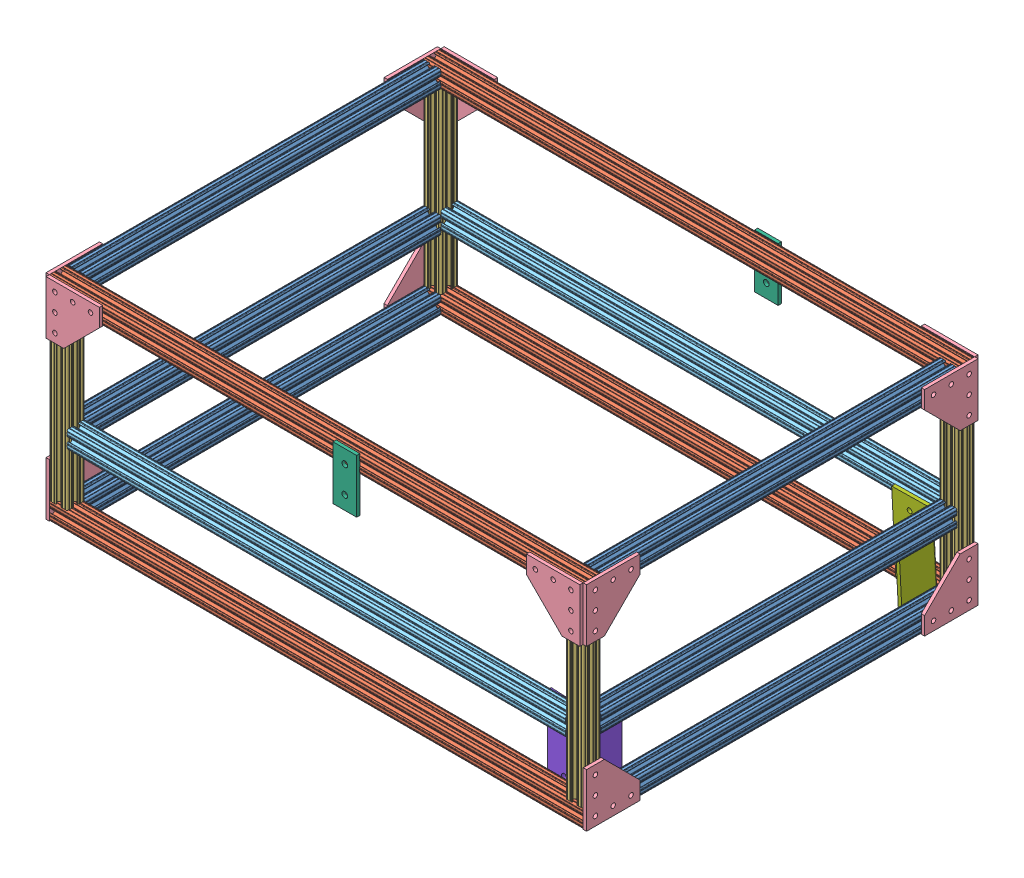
SolidWorks assembly Base Without Wheels+Plate+Angle iron.SLDASM, configuration Default (file format 10000). Lengths in mm.
Overall size (771.55 304.86 568.83).
32 component instances, 8 part files, 77 mates.
Components (placement in the parent):
- 1010 20in-2: 1010 20in.SLDPRT [Default] at (231.3281 508 268.5426) size (25.4 25.4 508)
- 1010 30in-1: 1010 30in.SLDPRT [Default] at (-517.9719 508 281.2426) x (0 0 1) z (-1 0 0) size (25.4 25.4 762)
- 1010 30in-2: 1010 30in.SLDPRT [Default] at (-517.9719 508 -252.1574) x (0 0 1) z (-1 0 0) size (25.4 25.4 762)
- 1010 20in-3: 1010 20in.SLDPRT [Default] at (-505.2719 508 268.5426) size (25.4 25.4 508)
- 1010 10in-1: 1010 10in.SLDPRT [Default] at (231.3281 520.7 281.2426) x (1 0 0) z (0 -1 0) size (25.4 25.4 254)
- 1010 10in-2: 1010 10in.SLDPRT [Default] at (231.3281 520.7 -252.1574) x (1 0 0) z (0 -1 0) size (25.4 25.4 254)
- 1010 10in-3: 1010 10in.SLDPRT [Default] at (-505.2719 520.7 -252.1574) x (1 0 0) z (0 -1 0) size (25.4 25.4 254)
- 1010 10in-4: 1010 10in.SLDPRT [Default] at (-505.2719 520.7 281.2426) x (1 0 0) z (0 -1 0) size (25.4 25.4 254)
- 1010 30in-3: 1010 30in.SLDPRT [Default] at (244.0281 787.4 -252.1574) x (0 0 -1) z (1 0 0) size (25.4 25.4 762)
- 1010 20in-4: 1010 20in.SLDPRT [Default] at (231.3281 787.4 268.5426) size (25.4 25.4 508)
- 1010 30in-4: 1010 30in.SLDPRT [Default] at (-517.9719 787.4 281.2426) x (0 -1 0) z (-1 0 0) size (25.4 25.4 762)
- 1010 20in-5: 1010 20in.SLDPRT [Default] at (-505.2719 787.4 268.5426) size (25.4 25.4 508)
- 4151-1: 4151.sldprt [Default] at (248.8033 495.3 255.8426) x (0 0 1) z (-1 0 0) size (76.2 76.2 4.78)
- 4151-2: 4151.sldprt [Default] at (244.0281 495.3 -226.7574) x (0 0 -1) z (1 0 0) size (76.2 76.2 4.78)
- 4151-3: 4151.sldprt [Default] at (-522.7471 533.4 293.9426) x (0 -1 0) z (1 0 0) size (76.2 76.2 4.78)
- 4151-4: 4151.sldprt [Default] at (-522.7471 495.3 -226.7574) x (0 0 -1) z (1 0 0) size (76.2 76.2 4.78)
- 4151-5: 4151.sldprt [Default] at (248.8033 800.1 -226.7574) x (0 0 -1) z (-1 0 0) size (76.2 76.2 4.78)
- 4151-6: 4151.sldprt [Default] at (248.8033 762 293.9426) x (0 1 0) z (-1 0 0) size (76.2 76.2 4.78)
- 4151-7: 4151.sldprt [Default] at (244.0281 762 293.9426) x (0 1 0) z (0 0 1) size (76.2 76.2 4.78)
- 4151-8: 4151.sldprt [Default] at (244.0281 762 -269.6326) x (0 1 0) z (0 0 1) size (76.2 76.2 4.78)
- 4151-9: 4151.sldprt [Default] at (-522.7471 762 -264.8574) x (0 1 0) z (1 0 0) size (76.2 76.2 4.78)
- 4151-10: 4151.sldprt [Default] at (-522.7471 800.1 255.8426) x (0 0 1) z (1 0 0) size (76.2 76.2 4.78)
- 4151-11: 4151.sldprt [Default] at (-517.9719 762 298.7178) x (0 1 0) z (0 0 -1) size (76.2 76.2 4.78)
- 4151-12: 4151.sldprt [Default] at (-517.9719 762 -264.8574) x (0 1 0) z (0 0 -1) size (76.2 76.2 4.78)
- 1010 28in-1: 1010 28in.SLDPRT [Default] at (-492.5719 608.8386 281.2426) x (0 0 1) z (-1 0 0) size (25.4 25.4 711.2)
- 1010 28in-2: 1010 28in.SLDPRT [Default] at (-492.5719 612.9856 -252.1574) x (0 0 1) z (-1 0 0) size (25.4 25.4 711.2)
- 1010 20in-6: 1010 20in.SLDPRT [Default] at (231.3281 612.74 268.5426) size (25.4 25.4 508)
- 1010 20in-7: 1010 20in.SLDPRT [Default] at (-505.2719 606.9045 268.5426) size (25.4 25.4 508)
- Mad Ants Base Design Plate-1: Mad Ants Base Design Plate.SLDPRT [Default] at (-91.9558 761.9341 293.5259) size (33.78 76.45 4.67)
- Mad Ants Base Design Plate-2: Mad Ants Base Design Plate.SLDPRT [Default] at (-53.9332 760.9111 -270.1149) size (33.78 76.45 4.67)
- Right Angle iron-1: Right Angle iron.SLDPRT [Default] at (216.7236 558.8587 -211.4769) x (0.00966 0.027218 -0.999583) z (-0.999631 -0.025135 -0.010345) size (50.8 114.3 55.88)
- Left angle part-1: Left angle part.SLDPRT [Default] at (188.8149 555.8715 265.8388) x (-0.998639 -0.00797 -0.051533) z (0.051609 -0.009544 -0.998622) size (50.8 114.3 55.88)
Mates (geometry in assembly coordinates):
- Coincident5: coincident aligned: plane of 1010 20in-2 through (244.0281 514.3331 -239.4574) normal (1 0 0); plane of 1010 30in-1 through (244.0281 500.3292 279.5333) normal (1 0 0)
- Coincident6: coincident anti-aligned: plane of 1010 20in-2 through (229.6188 500.3292 268.5426) normal (0 0 1); plane of 1010 30in-1 through (244.0281 498.4496 268.5426) normal (0 0 -1)
- Coincident7: coincident aligned: plane of 1010 20in-2 through (221.7776 520.7 -239.4574) normal (0 1 0); plane of 1010 30in-1 through (244.0281 520.7 271.6921) normal (0 1 0)
- Coincident8: coincident anti-aligned: plane of 1010 20in-2 through (229.6188 500.3292 -239.4574) normal (0 0 -1); plane of 1010 30in-2 through (244.0281 514.3331 -239.4574) normal (0 0 1)
- Coincident9: coincident aligned: plane of 1010 20in-2 through (244.0281 514.3331 -239.4574) normal (1 0 0); plane of 1010 30in-2 through (244.0281 500.3292 -253.8667) normal (1 0 0)
- Coincident10: coincident aligned: plane of 1010 20in-2 through (221.7776 520.7 -239.4574) normal (0 1 0); plane of 1010 30in-2 through (244.0281 520.7 -242.607) normal (0 1 0)
- Coincident11: coincident anti-aligned: plane of 1010 30in-2 through (244.0281 514.3331 -239.4574) normal (0 0 1); plane of 1010 20in-3 through (-506.9812 500.3292 -239.4574) normal (0 0 -1)
- Coincident12: coincident aligned: plane of 1010 30in-2 through (244.0281 520.7 -242.607) normal (0 1 0); plane of 1010 20in-3 through (-514.8224 520.7 -239.4574) normal (0 1 0)
- Coincident13: coincident aligned: plane of 1010 30in-2 through (-517.9719 500.3292 -253.8667) normal (-1 0 0); plane of 1010 20in-3 through (-517.9719 514.3331 -239.4574) normal (-1 0 0)
- Coincident14: coincident anti-aligned: plane of 1010 30in-1 through (244.0281 520.7 271.6921) normal (0 1 0); plane of 1010 10in-1 through (229.6188 520.7 273.5718) normal (0 -1 0)
- Coincident15: coincident aligned: plane of 1010 30in-1 through (244.0281 500.3292 279.5333) normal (1 0 0); plane of 1010 10in-1 through (244.0281 774.7 287.5756) normal (1 0 0)
- Coincident16: coincident aligned: plane of 1010 30in-1 through (244.0281 514.3331 293.9426) normal (0 0 1); plane of 1010 10in-1 through (221.7776 774.7 293.9426) normal (0 0 1)
- Coincident17: coincident anti-aligned: plane of 1010 30in-2 through (244.0281 520.7 -261.7079) normal (0 1 0); plane of 1010 10in-2 through (229.6188 520.7 -259.8282) normal (0 -1 0)
- Coincident18: coincident aligned: plane of 1010 30in-2 through (244.0281 500.3292 -253.8667) normal (1 0 0); plane of 1010 10in-2 through (244.0281 774.7 -245.8244) normal (1 0 0)
- Coincident19: coincident aligned: plane of 1010 30in-2 through (244.0281 514.3331 -264.8574) normal (0 0 -1); plane of 1010 10in-2 through (224.9949 774.7 -264.8574) normal (0 0 -1)
- Coincident20: coincident anti-aligned: plane of 1010 30in-2 through (244.0281 520.7 -261.7079) normal (0 1 0); plane of 1010 10in-3 through (-506.9812 520.7 -259.8282) normal (0 -1 0)
- Coincident21: coincident aligned: plane of 1010 30in-2 through (-517.9719 500.3292 -253.8667) normal (-1 0 0); plane of 1010 10in-3 through (-517.9719 774.7 -261.7078) normal (-1 0 0)
- Coincident22: coincident aligned: plane of 1010 30in-2 through (244.0281 514.3331 -264.8574) normal (0 0 -1); plane of 1010 10in-3 through (-511.6051 774.7 -264.8574) normal (0 0 -1)
- Coincident23: coincident anti-aligned: plane of 1010 30in-1 through (244.0281 520.7 271.6921) normal (0 1 0); plane of 1010 10in-4 through (-506.9812 520.7 273.5718) normal (0 -1 0)
- Coincident24: coincident aligned: plane of 1010 30in-1 through (-517.9719 500.3292 279.5333) normal (-1 0 0); plane of 1010 10in-4 through (-517.9719 774.7 287.5756) normal (-1 0 0)
- Coincident25: coincident aligned: plane of 1010 30in-1 through (244.0281 514.3331 293.9426) normal (0 0 1); plane of 1010 10in-4 through (-514.8224 774.7 293.9426) normal (0 0 1)
- Coincident28: coincident anti-aligned: plane of 1010 10in-2 through (229.6188 774.7 -259.8282) normal (0 1 0); plane of 1010 30in-3 through (-517.9719 774.7 -245.8243) normal (0 -1 0)
- Coincident29: coincident aligned: plane of 1010 10in-2 through (244.0281 774.7 -261.7078) normal (1 0 0); plane of 1010 30in-3 through (244.0281 779.7292 -250.4482) normal (1 0 0)
- Coincident30: coincident aligned: plane of 1010 10in-2 through (221.7776 774.7 -239.4574) normal (0 0 1); plane of 1010 30in-3 through (-517.9719 793.7331 -239.4574) normal (0 0 1)
- Coincident31: coincident anti-aligned: plane of 1010 30in-3 through (-517.9719 793.7331 -239.4574) normal (0 0 1); plane of 1010 20in-4 through (229.6188 779.7292 -239.4574) normal (0 0 -1)
- Coincident32: coincident aligned: plane of 1010 30in-3 through (244.0281 779.7292 -250.4482) normal (1 0 0); plane of 1010 20in-4 through (244.0281 793.7331 -239.4574) normal (1 0 0)
- Coincident33: coincident aligned: plane of 1010 30in-3 through (-517.9719 800.1 -242.607) normal (0 1 0); plane of 1010 20in-4 through (221.7776 800.1 -239.4574) normal (0 1 0)
- Coincident34: coincident aligned: plane of 1010 20in-4 through (244.0281 793.7331 -239.4574) normal (1 0 0); plane of 1010 30in-4 through (244.0281 789.1093 273.5718) normal (1 0 0)
- Coincident35: coincident anti-aligned: plane of 1010 20in-4 through (229.6188 779.7292 268.5426) normal (0 0 1); plane of 1010 30in-4 through (244.0281 793.7331 268.5426) normal (0 0 -1)
- Coincident36: coincident aligned: plane of 1010 20in-4 through (221.7776 800.1 -239.4574) normal (0 1 0); plane of 1010 30in-4 through (244.0281 800.1 271.6922) normal (0 1 0)
- Coincident37: coincident anti-aligned: plane of 1010 30in-3 through (-517.9719 793.7331 -239.4574) normal (0 0 1); plane of 1010 20in-5 through (-506.9812 779.7292 -239.4574) normal (0 0 -1)
- Coincident38: coincident aligned: plane of 1010 30in-3 through (-517.9719 800.1 -242.607) normal (0 1 0); plane of 1010 20in-5 through (-514.8224 800.1 -239.4574) normal (0 1 0)
- Coincident39: coincident aligned: plane of 1010 30in-3 through (-517.9719 779.7292 -250.4482) normal (-1 0 0); plane of 1010 20in-5 through (-517.9719 777.8496 -239.4574) normal (-1 0 0)
- Coincident40: coincident aligned: plane of 1010 30in-1 through (244.0281 498.4496 293.9426) normal (0 0 1); plane of 4151-1 through (248.8033 495.3 293.9426) normal (0 0 1)
- Coincident41: coincident anti-aligned: plane of 1010 30in-1 through (244.0281 500.3292 279.5333) normal (1 0 0); plane of 4151-1 through (244.0281 495.3 255.8426) normal (-1 0 0)
- Tangent1: tangent aligned: cylinder of 1010 30in-1 through (244.0281 497.4082 291.8344) axis (-1 0 0) radius 2.1082; plane of 4151-1 through (248.8033 495.3 217.7426) normal (0 -1 0)
- Coincident42: coincident anti-aligned: plane of 1010 30in-2 through (244.0281 500.3292 -253.8667) normal (1 0 0); plane of 4151-2 through (244.0281 495.3 -226.7574) normal (-1 0 0)
- Coincident43: coincident aligned: plane of 1010 30in-2 through (244.0281 495.3 -245.8243) normal (0 -1 0); plane of 4151-2 through (244.0281 495.3 -188.6574) normal (0 -1 0)
- Coincident44: coincident aligned: plane of 1010 30in-2 through (244.0281 498.4496 -264.8574) normal (0 0 -1); plane of 4151-2 through (244.0281 495.3 -264.8574) normal (0 0 -1)
- Coincident45: coincident anti-aligned: plane of 1010 30in-1 through (-517.9719 500.3292 279.5333) normal (-1 0 0); plane of 4151-3 through (-517.9719 533.4 293.9426) normal (1 0 0)
- Coincident46: coincident aligned: plane of 1010 30in-1 through (244.0281 514.3331 293.9426) normal (0 0 1); plane of 4151-3 through (-522.7471 571.5 293.9426) normal (0 0 1)
- Coincident47: coincident aligned: plane of 1010 20in-3 through (-511.6051 495.3 -239.4574) normal (0 -1 0); plane of 4151-3 through (-522.7471 495.3 293.9426) normal (0 -1 0)
- Coincident48: coincident anti-aligned: plane of 1010 30in-2 through (-517.9719 500.3292 -253.8667) normal (-1 0 0); plane of 4151-4 through (-517.9719 495.3 -226.7574) normal (1 0 0)
- Coincident49: coincident aligned: plane of 1010 30in-2 through (244.0281 495.3 -245.8243) normal (0 -1 0); plane of 4151-4 through (-522.7471 495.3 -188.6574) normal (0 -1 0)
- Coincident50: coincident aligned: plane of 1010 10in-3 through (-511.6051 774.7 -264.8574) normal (0 0 -1); plane of 4151-4 through (-522.7471 495.3 -264.8574) normal (0 0 -1)
- Coincident51: coincident anti-aligned: plane of 1010 30in-3 through (244.0281 779.7292 -250.4482) normal (1 0 0); plane of 4151-5 through (244.0281 800.1 -226.7574) normal (-1 0 0)
- Coincident52: coincident aligned: plane of 1010 30in-3 through (-517.9719 800.1 -242.607) normal (0 1 0); plane of 4151-5 through (248.8033 800.1 -188.6574) normal (0 1 0)
- Coincident53: coincident aligned: plane of 1010 30in-3 through (-517.9719 793.7331 -264.8574) normal (0 0 -1); plane of 4151-5 through (248.8033 800.1 -264.8574) normal (0 0 -1)
- Coincident54: coincident anti-aligned: plane of 1010 30in-4 through (244.0281 789.1093 273.5718) normal (1 0 0); plane of 4151-6 through (244.0281 762 293.9426) normal (-1 0 0)
- Coincident55: coincident aligned: plane of 1010 30in-4 through (244.0281 796.9504 293.9426) normal (0 0 1); plane of 4151-6 through (248.8033 723.9 293.9426) normal (0 0 1)
- Coincident56: coincident aligned: plane of 1010 20in-4 through (240.8785 800.1 -239.4574) normal (0 1 0); plane of 4151-6 through (248.8033 800.1 293.9426) normal (0 1 0)
- Coincident57: coincident anti-aligned: plane of 1010 30in-4 through (244.0281 796.9504 293.9426) normal (0 0 1); plane of 4151-7 through (244.0281 762 293.9426) normal (0 0 -1)
- Coincident58: coincident aligned: plane of 1010 30in-4 through (244.0281 800.1 287.5756) normal (0 1 0); plane of 4151-7 through (244.0281 800.1 293.9426) normal (0 1 0)
- Coincident59: coincident: line of 4151-6 through (244.0281 723.9 293.9426) axis (0 1 0); plane of 4151-7 through (244.0281 723.9 293.9426) normal (1 0 0)
- Coincident60: coincident anti-aligned: plane of 1010 30in-3 through (-517.9719 793.7331 -264.8574) normal (0 0 -1); plane of 4151-8 through (244.0281 762 -264.8574) normal (0 0 1)
- Coincident61: coincident aligned: plane of 1010 30in-3 through (-517.9719 800.1 -261.7079) normal (0 1 0); plane of 4151-8 through (244.0281 800.1 -269.6326) normal (0 1 0)
- Coincident62: coincident: line of 4151-5 through (244.0281 800.1 -264.8574) axis (0 -1 0); plane of 4151-8 through (244.0281 723.9 -269.6326) normal (1 0 0)
- Coincident63: coincident anti-aligned: plane of 1010 30in-3 through (-517.9719 779.7292 -250.4482) normal (-1 0 0); plane of 4151-9 through (-517.9719 762 -264.8574) normal (1 0 0)
- Coincident64: coincident aligned: plane of 1010 30in-3 through (-517.9719 800.1 -242.607) normal (0 1 0); plane of 4151-9 through (-522.7471 800.1 -264.8574) normal (0 1 0)
- Coincident65: coincident aligned: plane of 1010 30in-3 through (-517.9719 793.7331 -264.8574) normal (0 0 -1); plane of 4151-9 through (-522.7471 723.9 -264.8574) normal (0 0 -1)
- Coincident66: coincident anti-aligned: plane of 1010 30in-4 through (-517.9719 789.1093 273.5718) normal (-1 0 0); plane of 4151-10 through (-517.9719 800.1 255.8426) normal (1 0 0)
- Coincident67: coincident aligned: plane of 1010 30in-4 through (244.0281 800.1 271.6922) normal (0 1 0); plane of 4151-10 through (-522.7471 800.1 217.7426) normal (0 1 0)
- Coincident68: coincident aligned: plane of 1010 30in-4 through (244.0281 796.9504 293.9426) normal (0 0 1); plane of 4151-10 through (-522.7471 800.1 293.9426) normal (0 0 1)
- Coincident69: coincident anti-aligned: plane of 1010 30in-4 through (244.0281 796.9504 293.9426) normal (0 0 1); plane of 4151-11 through (-517.9719 762 293.9426) normal (0 0 -1)
- Coincident70: coincident aligned: plane of 1010 30in-4 through (244.0281 800.1 287.5756) normal (0 1 0); plane of 4151-11 through (-517.9719 800.1 298.7178) normal (0 1 0)
- Coincident71: coincident: line of 4151-10 through (-517.9719 800.1 293.9426) axis (0 -1 0); plane of 4151-11 through (-517.9719 723.9 298.7178) normal (-1 0 0)
- Coincident72: coincident anti-aligned: plane of 1010 30in-3 through (-517.9719 793.7331 -264.8574) normal (0 0 -1); plane of 4151-12 through (-517.9719 762 -264.8574) normal (0 0 1)
- Coincident73: coincident aligned: plane of 1010 30in-3 through (-517.9719 800.1 -261.7079) normal (0 1 0); plane of 4151-12 through (-517.9719 800.1 -264.8574) normal (0 1 0)
- Coincident74: coincident: line of 4151-9 through (-517.9719 723.9 -264.8574) axis (0 1 0); plane of 4151-12 through (-517.9719 723.9 -264.8574) normal (-1 0 0)
- Coincident75: coincident anti-aligned: plane of 1010 10in-1 through (218.6281 774.7 271.6922) normal (-1 0 0); plane of 1010 28in-1 through (218.6281 601.1678 279.5333) normal (1 0 0)
- Coincident76: coincident anti-aligned: plane of 1010 10in-2 through (218.6281 774.7 -261.7078) normal (-1 0 0); plane of 1010 28in-2 through (218.6281 605.3148 -253.8667) normal (1 0 0)
- Coincident77: coincident aligned: plane of 1010 10in-2 through (224.9949 774.7 -264.8574) normal (0 0 -1); plane of 1010 28in-2 through (218.6281 619.3187 -264.8574) normal (0 0 -1)
- Coincident78: coincident aligned: plane of 1010 10in-1 through (221.7776 774.7 293.9426) normal (0 0 1); plane of 1010 28in-1 through (218.6281 615.1717 293.9426) normal (0 0 1)
- Coincident79: coincident anti-aligned: plane of 1010 10in-2 through (240.8785 774.7 -239.4574) normal (0 0 1); plane of 1010 20in-6 through (229.6188 605.0692 -239.4574) normal (0 0 -1)
- Coincident80: coincident aligned: plane of 1010 10in-2 through (244.0281 774.7 -245.8244) normal (1 0 0); plane of 1010 20in-6 through (244.0281 619.0731 -239.4574) normal (1 0 0)
- Coincident81: coincident anti-aligned: plane of 1010 10in-3 through (-514.8224 774.7 -239.4574) normal (0 0 1); plane of 1010 20in-7 through (-506.9812 599.2337 -239.4574) normal (0 0 -1)
- Coincident82: coincident aligned: plane of 1010 10in-3 through (-517.9719 774.7 -245.8244) normal (-1 0 0); plane of 1010 20in-7 through (-517.9719 613.2376 -239.4574) normal (-1 0 0)
